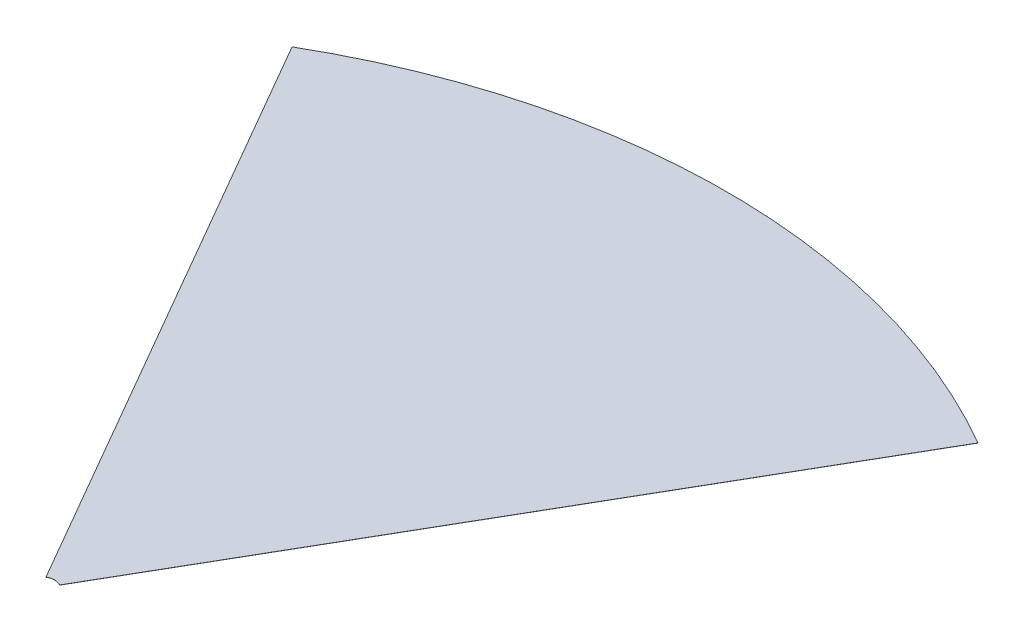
from build123d import *

# Parameters (mm, degrees)
EXTRUDE2_DEPTH = 0.01


with BuildPart() as part:
    # Sketch3 → Extrude2 (new body)
    with BuildSketch(Plane(origin=(0, 0, 0), x_dir=(1, 0, 0), z_dir=(0, 1, 0))):
        with BuildLine():
            Line((0.5, 0.866025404), (25, 43.301270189))
            ThreePointArc((25, 43.301270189), (0, 50), (-25, 43.301270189))
            Line((-25, 43.301270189), (-0.5, 0.866025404))
            ThreePointArc((-0.5, 0.866025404), (0, 1), (0.5, 0.866025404))
        make_face()
    extrude(amount=EXTRUDE2_DEPTH)


solid = part.part
